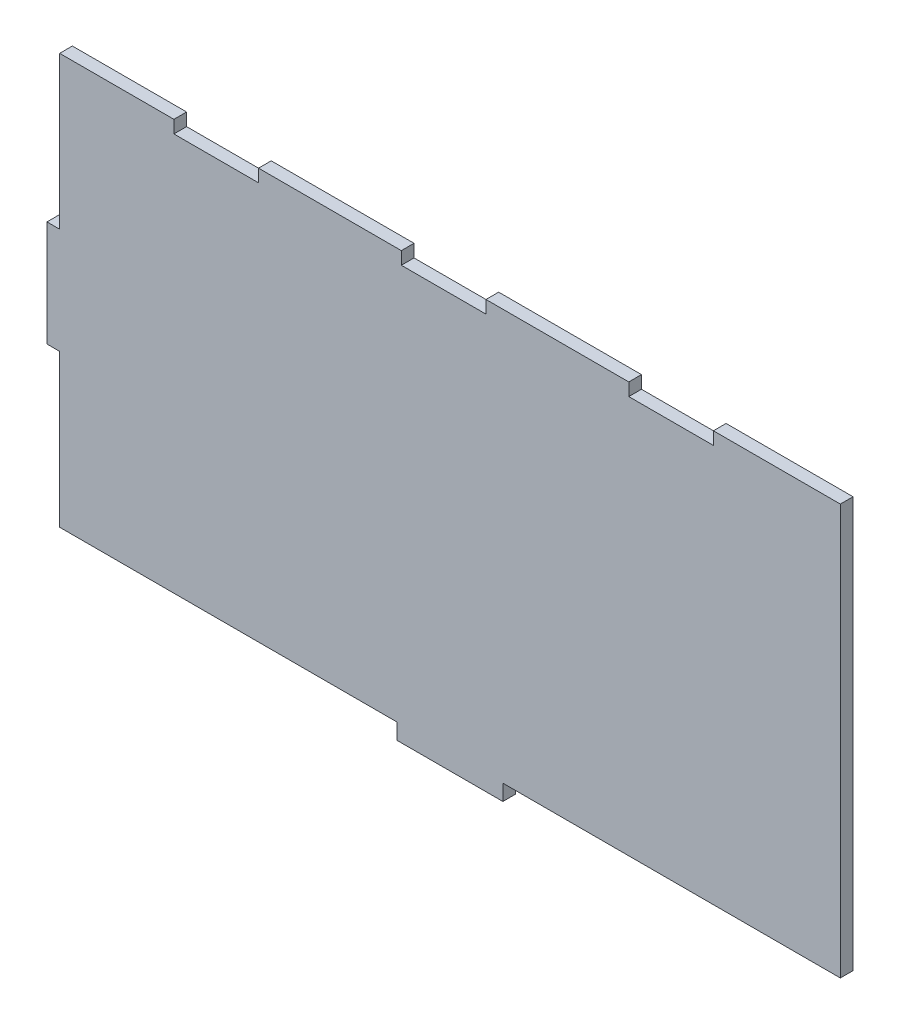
from build123d import *

# Parameters (mm, degrees)
SALIENTE_EXTRUIR2_DEPTH = 12


with BuildPart() as part:
    # Croquis1 → Saliente-Extruir2 (new body)
    with BuildSketch(Plane.XY):
        Polygon((-261, 194), (-369, 194), (-369, 50), (-381, 50), (-381, -50), (-369, -50), (-369, -194), (-50, -194), (-50, -209), (50, -209), (50, -194), (369, -194), (369, 194), (249, 194), (249, 182), (169, 182), (169, 194), (34, 194), (34, 182), (-46, 182), (-46, 194), (-181, 194), (-181, 182), (-261, 182), align=None)
    extrude(amount=SALIENTE_EXTRUIR2_DEPTH)


solid = part.part
